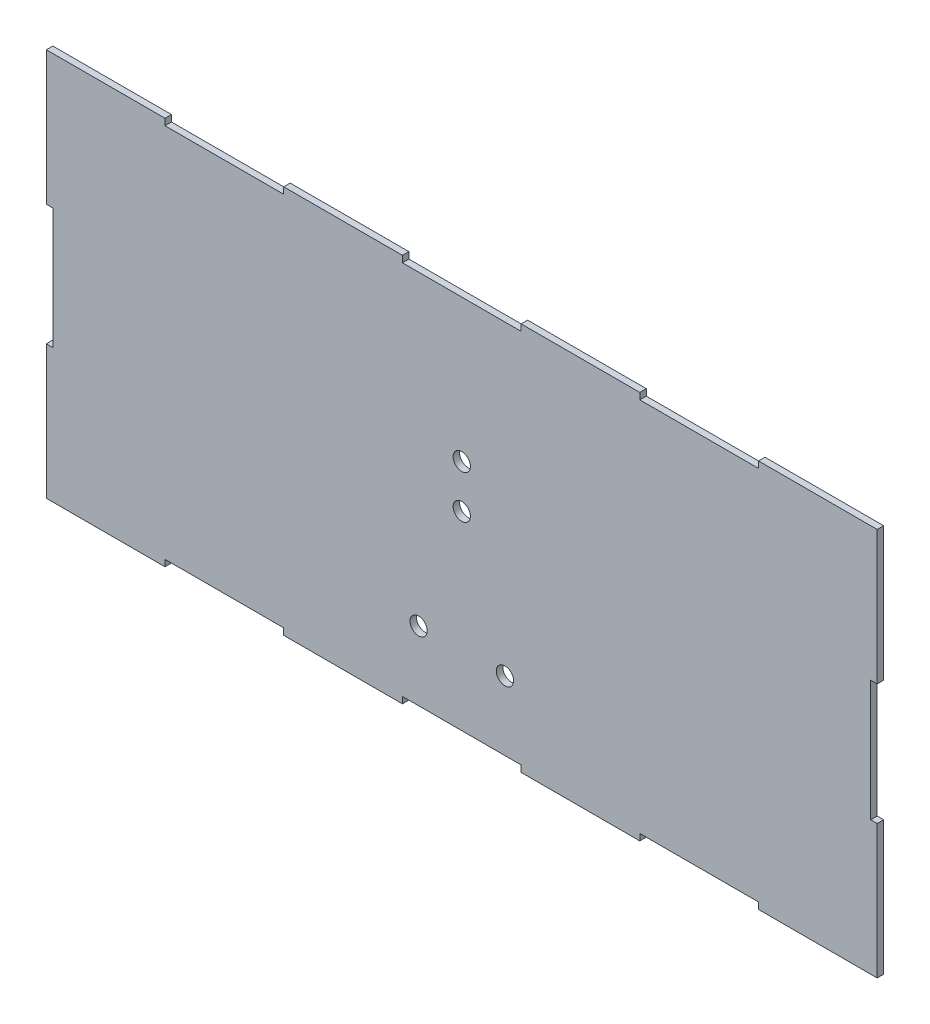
ISO-10303-21;
HEADER;
FILE_DESCRIPTION(('STEP AP214'),'2;1');
FILE_NAME('part.step','',(''),(''),'','','');
FILE_SCHEMA(('AUTOMOTIVE_DESIGN { 1 0 10303 214 1 1 1 1 }'));
ENDSEC;
DATA;
#1=APPLICATION_CONTEXT('core data for automotive mechanical design processes');
#2=APPLICATION_PROTOCOL_DEFINITION('international standard','automotive_design',2000,#1);
#3=PRODUCT_CONTEXT('',#1,'mechanical');
#4=PRODUCT('Part','Part','',(#3));
#5=PRODUCT_RELATED_PRODUCT_CATEGORY('part','',(#4));
#6=PRODUCT_DEFINITION_FORMATION('','',#4);
#7=PRODUCT_DEFINITION_CONTEXT('part definition',#1,'design');
#8=PRODUCT_DEFINITION('design','',#6,#7);
#9=PRODUCT_DEFINITION_SHAPE('','',#8);
#10=(LENGTH_UNIT() NAMED_UNIT(*) SI_UNIT(.MILLI.,.METRE.));
#11=(NAMED_UNIT(*) PLANE_ANGLE_UNIT() SI_UNIT($,.RADIAN.));
#12=(NAMED_UNIT(*) SI_UNIT($,.STERADIAN.) SOLID_ANGLE_UNIT());
#13=UNCERTAINTY_MEASURE_WITH_UNIT(LENGTH_MEASURE(1.E-05),#10,'distance_accuracy_value','');
#14=(GEOMETRIC_REPRESENTATION_CONTEXT(3) GLOBAL_UNCERTAINTY_ASSIGNED_CONTEXT((#13)) GLOBAL_UNIT_ASSIGNED_CONTEXT((#10,
#11,#12)) REPRESENTATION_CONTEXT('',''));
#15=CARTESIAN_POINT('',(0.,0.,0.));
#16=DIRECTION('',(0.,0.,1.));
#17=DIRECTION('',(1.,0.,0.));
#18=AXIS2_PLACEMENT_3D('',#15,#16,#17);
#19=CARTESIAN_POINT('',(192.5,90.,3.));
#20=DIRECTION('',(-1.,0.,0.));
#21=DIRECTION('',(0.,-1.,0.));
#22=AXIS2_PLACEMENT_3D('',#19,#20,#21);
#23=PLANE('',#22);
#24=DIRECTION('',(0.,1.,0.));
#25=VECTOR('',#24,1.);
#26=CARTESIAN_POINT('',(192.5,90.,3.));
#27=LINE('',#26,#25);
#28=CARTESIAN_POINT('',(192.5,28.,3.));
#29=VERTEX_POINT('',#28);
#30=CARTESIAN_POINT('',(192.5,90.,3.));
#31=VERTEX_POINT('',#30);
#32=EDGE_CURVE('E509',#29,#31,#27,.T.);
#33=ORIENTED_EDGE('',*,*,#32,.F.);
#34=DIRECTION('',(0.,0.,1.));
#35=VECTOR('',#34,1.);
#36=CARTESIAN_POINT('',(192.5,28.,0.));
#37=LINE('',#36,#35);
#38=CARTESIAN_POINT('',(192.5,28.,0.));
#39=VERTEX_POINT('',#38);
#40=EDGE_CURVE('E297',#39,#29,#37,.T.);
#41=ORIENTED_EDGE('',*,*,#40,.F.);
#42=DIRECTION('',(0.,1.,0.));
#43=VECTOR('',#42,1.);
#44=CARTESIAN_POINT('',(192.5,90.,0.));
#45=LINE('',#44,#43);
#46=CARTESIAN_POINT('',(192.5,90.,0.));
#47=VERTEX_POINT('',#46);
#48=EDGE_CURVE('E502',#39,#47,#45,.T.);
#49=ORIENTED_EDGE('',*,*,#48,.T.);
#50=DIRECTION('',(0.,0.,-1.));
#51=VECTOR('',#50,1.);
#52=CARTESIAN_POINT('',(192.5,90.,3.));
#53=LINE('',#52,#51);
#54=EDGE_CURVE('E11',#31,#47,#53,.T.);
#55=ORIENTED_EDGE('',*,*,#54,.F.);
#56=EDGE_LOOP('',(#33,#41,#49,#55));
#57=FACE_BOUND('',#56,.T.);
#58=ADVANCED_FACE('F32',(#57),#23,.F.);
#59=CARTESIAN_POINT('',(-192.5,90.,3.));
#60=DIRECTION('',(1.,0.,0.));
#61=DIRECTION('',(0.,1.,0.));
#62=AXIS2_PLACEMENT_3D('',#59,#60,#61);
#63=PLANE('',#62);
#64=DIRECTION('',(0.,-1.,0.));
#65=VECTOR('',#64,1.);
#66=CARTESIAN_POINT('',(-192.5,90.,0.));
#67=LINE('',#66,#65);
#68=CARTESIAN_POINT('',(-192.5,90.,0.));
#69=VERTEX_POINT('',#68);
#70=CARTESIAN_POINT('',(-192.5,28.,0.));
#71=VERTEX_POINT('',#70);
#72=EDGE_CURVE('E534',#69,#71,#67,.T.);
#73=ORIENTED_EDGE('',*,*,#72,.T.);
#74=DIRECTION('',(0.,0.,1.));
#75=VECTOR('',#74,1.);
#76=CARTESIAN_POINT('',(-192.5,28.,0.));
#77=LINE('',#76,#75);
#78=CARTESIAN_POINT('',(-192.5,28.,3.));
#79=VERTEX_POINT('',#78);
#80=EDGE_CURVE('E315',#71,#79,#77,.T.);
#81=ORIENTED_EDGE('',*,*,#80,.T.);
#82=DIRECTION('',(0.,-1.,0.));
#83=VECTOR('',#82,1.);
#84=CARTESIAN_POINT('',(-192.5,90.,3.));
#85=LINE('',#84,#83);
#86=CARTESIAN_POINT('',(-192.5,90.,3.));
#87=VERTEX_POINT('',#86);
#88=EDGE_CURVE('E516',#87,#79,#85,.T.);
#89=ORIENTED_EDGE('',*,*,#88,.F.);
#90=DIRECTION('',(0.,0.,-1.));
#91=VECTOR('',#90,1.);
#92=CARTESIAN_POINT('',(-192.5,90.,3.));
#93=LINE('',#92,#91);
#94=EDGE_CURVE('E40',#87,#69,#93,.T.);
#95=ORIENTED_EDGE('',*,*,#94,.T.);
#96=EDGE_LOOP('',(#73,#81,#89,#95));
#97=FACE_BOUND('',#96,.T.);
#98=ADVANCED_FACE('F551',(#97),#63,.F.);
#99=CARTESIAN_POINT('',(-192.5,90.,3.));
#100=DIRECTION('',(0.,-1.,0.));
#101=DIRECTION('',(0.,0.,-1.));
#102=AXIS2_PLACEMENT_3D('',#99,#100,#101);
#103=PLANE('',#102);
#104=DIRECTION('',(-1.,0.,0.));
#105=VECTOR('',#104,1.);
#106=CARTESIAN_POINT('',(-192.5,90.,0.));
#107=LINE('',#106,#105);
#108=CARTESIAN_POINT('',(-27.5000000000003,90.,0.));
#109=VERTEX_POINT('',#108);
#110=CARTESIAN_POINT('',(-82.5000000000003,90.,0.));
#111=VERTEX_POINT('',#110);
#112=EDGE_CURVE('E533',#109,#111,#107,.T.);
#113=ORIENTED_EDGE('',*,*,#112,.T.);
#114=DIRECTION('',(0.,0.,1.));
#115=VECTOR('',#114,1.);
#116=CARTESIAN_POINT('',(-82.5000000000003,90.,0.));
#117=LINE('',#116,#115);
#118=CARTESIAN_POINT('',(-82.5000000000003,90.,3.));
#119=VERTEX_POINT('',#118);
#120=EDGE_CURVE('E341',#111,#119,#117,.T.);
#121=ORIENTED_EDGE('',*,*,#120,.T.);
#122=DIRECTION('',(-1.,0.,0.));
#123=VECTOR('',#122,1.);
#124=CARTESIAN_POINT('',(-192.5,90.,3.));
#125=LINE('',#124,#123);
#126=CARTESIAN_POINT('',(-27.5000000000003,90.,3.));
#127=VERTEX_POINT('',#126);
#128=EDGE_CURVE('E515',#127,#119,#125,.T.);
#129=ORIENTED_EDGE('',*,*,#128,.F.);
#130=DIRECTION('',(0.,0.,1.));
#131=VECTOR('',#130,1.);
#132=CARTESIAN_POINT('',(-27.5000000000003,90.,0.));
#133=LINE('',#132,#131);
#134=EDGE_CURVE('E394',#109,#127,#133,.T.);
#135=ORIENTED_EDGE('',*,*,#134,.F.);
#136=EDGE_LOOP('',(#113,#121,#129,#135));
#137=FACE_BOUND('',#136,.T.);
#138=ADVANCED_FACE('F596',(#137),#103,.F.);
#139=CARTESIAN_POINT('',(137.5,90.,0.));
#140=VERTEX_POINT('',#139);
#141=EDGE_CURVE('E528',#47,#140,#107,.T.);
#142=ORIENTED_EDGE('',*,*,#141,.T.);
#143=DIRECTION('',(0.,0.,1.));
#144=VECTOR('',#143,1.);
#145=CARTESIAN_POINT('',(137.5,90.,0.));
#146=LINE('',#145,#144);
#147=CARTESIAN_POINT('',(137.5,90.,3.));
#148=VERTEX_POINT('',#147);
#149=EDGE_CURVE('E360',#140,#148,#146,.T.);
#150=ORIENTED_EDGE('',*,*,#149,.T.);
#151=EDGE_CURVE('E510',#31,#148,#125,.T.);
#152=ORIENTED_EDGE('',*,*,#151,.F.);
#153=ORIENTED_EDGE('',*,*,#54,.T.);
#154=EDGE_LOOP('',(#142,#150,#152,#153));
#155=FACE_BOUND('',#154,.T.);
#156=ADVANCED_FACE('F952',(#155),#103,.F.);
#157=CARTESIAN_POINT('',(-137.5,90.,3.));
#158=VERTEX_POINT('',#157);
#159=EDGE_CURVE('E508',#158,#87,#125,.T.);
#160=ORIENTED_EDGE('',*,*,#159,.F.);
#161=DIRECTION('',(0.,0.,1.));
#162=VECTOR('',#161,1.);
#163=CARTESIAN_POINT('',(-137.5,90.,0.));
#164=LINE('',#163,#162);
#165=CARTESIAN_POINT('',(-137.5,90.,0.));
#166=VERTEX_POINT('',#165);
#167=EDGE_CURVE('E334',#166,#158,#164,.T.);
#168=ORIENTED_EDGE('',*,*,#167,.F.);
#169=EDGE_CURVE('E527',#166,#69,#107,.T.);
#170=ORIENTED_EDGE('',*,*,#169,.T.);
#171=ORIENTED_EDGE('',*,*,#94,.F.);
#172=EDGE_LOOP('',(#160,#168,#170,#171));
#173=FACE_BOUND('',#172,.T.);
#174=ADVANCED_FACE('F583',(#173),#103,.F.);
#175=CARTESIAN_POINT('',(-192.5,-90.,3.));
#176=DIRECTION('',(0.,1.,0.));
#177=DIRECTION('',(0.,0.,1.));
#178=AXIS2_PLACEMENT_3D('',#175,#176,#177);
#179=PLANE('',#178);
#180=DIRECTION('',(1.,0.,0.));
#181=VECTOR('',#180,1.);
#182=CARTESIAN_POINT('',(-192.5,-90.,0.));
#183=LINE('',#182,#181);
#184=CARTESIAN_POINT('',(27.4999999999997,-90.,0.));
#185=VERTEX_POINT('',#184);
#186=CARTESIAN_POINT('',(82.5000000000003,-90.,0.));
#187=VERTEX_POINT('',#186);
#188=EDGE_CURVE('E636',#185,#187,#183,.T.);
#189=ORIENTED_EDGE('',*,*,#188,.T.);
#190=DIRECTION('',(0.,0.,1.));
#191=VECTOR('',#190,1.);
#192=CARTESIAN_POINT('',(82.5000000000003,-90.,0.));
#193=LINE('',#192,#191);
#194=CARTESIAN_POINT('',(82.5000000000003,-90.,3.));
#195=VERTEX_POINT('',#194);
#196=EDGE_CURVE('E420',#187,#195,#193,.T.);
#197=ORIENTED_EDGE('',*,*,#196,.T.);
#198=DIRECTION('',(1.,0.,0.));
#199=VECTOR('',#198,1.);
#200=CARTESIAN_POINT('',(-192.5,-90.,3.));
#201=LINE('',#200,#199);
#202=CARTESIAN_POINT('',(27.4999999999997,-90.,3.));
#203=VERTEX_POINT('',#202);
#204=EDGE_CURVE('E657',#203,#195,#201,.T.);
#205=ORIENTED_EDGE('',*,*,#204,.F.);
#206=DIRECTION('',(0.,0.,1.));
#207=VECTOR('',#206,1.);
#208=CARTESIAN_POINT('',(27.4999999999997,-90.,0.));
#209=LINE('',#208,#207);
#210=EDGE_CURVE('E446',#185,#203,#209,.T.);
#211=ORIENTED_EDGE('',*,*,#210,.F.);
#212=EDGE_LOOP('',(#189,#197,#205,#211));
#213=FACE_BOUND('',#212,.T.);
#214=ADVANCED_FACE('F667',(#213),#179,.F.);
#215=CARTESIAN_POINT('',(137.5,-90.,3.));
#216=VERTEX_POINT('',#215);
#217=CARTESIAN_POINT('',(192.5,-90.,3.));
#218=VERTEX_POINT('',#217);
#219=EDGE_CURVE('E519',#216,#218,#201,.T.);
#220=ORIENTED_EDGE('',*,*,#219,.F.);
#221=DIRECTION('',(0.,0.,1.));
#222=VECTOR('',#221,1.);
#223=CARTESIAN_POINT('',(137.5,-90.,0.));
#224=LINE('',#223,#222);
#225=CARTESIAN_POINT('',(137.5,-90.,0.));
#226=VERTEX_POINT('',#225);
#227=EDGE_CURVE('E413',#226,#216,#224,.T.);
#228=ORIENTED_EDGE('',*,*,#227,.F.);
#229=CARTESIAN_POINT('',(192.5,-90.,0.));
#230=VERTEX_POINT('',#229);
#231=EDGE_CURVE('E537',#226,#230,#183,.T.);
#232=ORIENTED_EDGE('',*,*,#231,.T.);
#233=DIRECTION('',(0.,0.,-1.));
#234=VECTOR('',#233,1.);
#235=CARTESIAN_POINT('',(192.5,-90.,3.));
#236=LINE('',#235,#234);
#237=EDGE_CURVE('E523',#218,#230,#236,.T.);
#238=ORIENTED_EDGE('',*,*,#237,.F.);
#239=EDGE_LOOP('',(#220,#228,#232,#238));
#240=FACE_BOUND('',#239,.T.);
#241=ADVANCED_FACE('F664',(#240),#179,.F.);
#242=CARTESIAN_POINT('',(-192.5,-90.,0.));
#243=VERTEX_POINT('',#242);
#244=CARTESIAN_POINT('',(-137.5,-90.,0.));
#245=VERTEX_POINT('',#244);
#246=EDGE_CURVE('E538',#243,#245,#183,.T.);
#247=ORIENTED_EDGE('',*,*,#246,.T.);
#248=DIRECTION('',(0.,0.,1.));
#249=VECTOR('',#248,1.);
#250=CARTESIAN_POINT('',(-137.5,-90.,0.));
#251=LINE('',#250,#249);
#252=CARTESIAN_POINT('',(-137.5,-90.,3.));
#253=VERTEX_POINT('',#252);
#254=EDGE_CURVE('E465',#245,#253,#251,.T.);
#255=ORIENTED_EDGE('',*,*,#254,.T.);
#256=CARTESIAN_POINT('',(-192.5,-90.,3.));
#257=VERTEX_POINT('',#256);
#258=EDGE_CURVE('E520',#257,#253,#201,.T.);
#259=ORIENTED_EDGE('',*,*,#258,.F.);
#260=DIRECTION('',(0.,0.,-1.));
#261=VECTOR('',#260,1.);
#262=CARTESIAN_POINT('',(-192.5,-90.,3.));
#263=LINE('',#262,#261);
#264=EDGE_CURVE('E544',#257,#243,#263,.T.);
#265=ORIENTED_EDGE('',*,*,#264,.T.);
#266=EDGE_LOOP('',(#247,#255,#259,#265));
#267=FACE_BOUND('',#266,.T.);
#268=ADVANCED_FACE('F666',(#267),#179,.F.);
#269=CARTESIAN_POINT('',(0.,0.,3.));
#270=DIRECTION('',(0.,0.,1.));
#271=DIRECTION('',(1.,0.,0.));
#272=AXIS2_PLACEMENT_3D('',#269,#270,#271);
#273=PLANE('',#272);
#274=DIRECTION('',(-1.,0.,0.));
#275=VECTOR('',#274,1.);
#276=CARTESIAN_POINT('',(189.5,28.,3.));
#277=LINE('',#276,#275);
#278=CARTESIAN_POINT('',(189.5,28.,3.));
#279=VERTEX_POINT('',#278);
#280=EDGE_CURVE('E286',#29,#279,#277,.T.);
#281=ORIENTED_EDGE('',*,*,#280,.F.);
#282=ORIENTED_EDGE('',*,*,#32,.T.);
#283=ORIENTED_EDGE('',*,*,#151,.T.);
#284=DIRECTION('',(0.,1.,0.));
#285=VECTOR('',#284,1.);
#286=CARTESIAN_POINT('',(137.5,90.,3.));
#287=LINE('',#286,#285);
#288=CARTESIAN_POINT('',(137.5,87.,3.));
#289=VERTEX_POINT('',#288);
#290=EDGE_CURVE('E344',#289,#148,#287,.T.);
#291=ORIENTED_EDGE('',*,*,#290,.F.);
#292=DIRECTION('',(1.,0.,0.));
#293=VECTOR('',#292,1.);
#294=CARTESIAN_POINT('',(137.5,87.,3.));
#295=LINE('',#294,#293);
#296=CARTESIAN_POINT('',(82.5000000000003,87.,3.));
#297=VERTEX_POINT('',#296);
#298=EDGE_CURVE('E354',#297,#289,#295,.T.);
#299=ORIENTED_EDGE('',*,*,#298,.F.);
#300=DIRECTION('',(0.,-1.,0.));
#301=VECTOR('',#300,1.);
#302=CARTESIAN_POINT('',(82.5000000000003,90.,3.));
#303=LINE('',#302,#301);
#304=CARTESIAN_POINT('',(82.5000000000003,90.,3.));
#305=VERTEX_POINT('',#304);
#306=EDGE_CURVE('E362',#305,#297,#303,.T.);
#307=ORIENTED_EDGE('',*,*,#306,.F.);
#308=CARTESIAN_POINT('',(27.4999999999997,90.,3.));
#309=VERTEX_POINT('',#308);
#310=EDGE_CURVE('E514',#305,#309,#125,.T.);
#311=ORIENTED_EDGE('',*,*,#310,.T.);
#312=DIRECTION('',(0.,1.,0.));
#313=VECTOR('',#312,1.);
#314=CARTESIAN_POINT('',(27.4999999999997,87.,3.));
#315=LINE('',#314,#313);
#316=CARTESIAN_POINT('',(27.4999999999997,87.,3.));
#317=VERTEX_POINT('',#316);
#318=EDGE_CURVE('E380',#317,#309,#315,.T.);
#319=ORIENTED_EDGE('',*,*,#318,.F.);
#320=DIRECTION('',(1.,0.,0.));
#321=VECTOR('',#320,1.);
#322=CARTESIAN_POINT('',(-27.5000000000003,87.,3.));
#323=LINE('',#322,#321);
#324=CARTESIAN_POINT('',(-27.5000000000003,87.,3.));
#325=VERTEX_POINT('',#324);
#326=EDGE_CURVE('E389',#325,#317,#323,.T.);
#327=ORIENTED_EDGE('',*,*,#326,.F.);
#328=DIRECTION('',(0.,-1.,0.));
#329=VECTOR('',#328,1.);
#330=CARTESIAN_POINT('',(-27.5000000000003,87.,3.));
#331=LINE('',#330,#329);
#332=EDGE_CURVE('E369',#127,#325,#331,.T.);
#333=ORIENTED_EDGE('',*,*,#332,.F.);
#334=ORIENTED_EDGE('',*,*,#128,.T.);
#335=DIRECTION('',(0.,1.,0.));
#336=VECTOR('',#335,1.);
#337=CARTESIAN_POINT('',(-82.5000000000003,90.,3.));
#338=LINE('',#337,#336);
#339=CARTESIAN_POINT('',(-82.5000000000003,87.,3.));
#340=VERTEX_POINT('',#339);
#341=EDGE_CURVE('E328',#340,#119,#338,.T.);
#342=ORIENTED_EDGE('',*,*,#341,.F.);
#343=DIRECTION('',(1.,0.,0.));
#344=VECTOR('',#343,1.);
#345=CARTESIAN_POINT('',(-137.5,87.,3.));
#346=LINE('',#345,#344);
#347=CARTESIAN_POINT('',(-137.5,87.,3.));
#348=VERTEX_POINT('',#347);
#349=EDGE_CURVE('E337',#348,#340,#346,.T.);
#350=ORIENTED_EDGE('',*,*,#349,.F.);
#351=DIRECTION('',(0.,-1.,0.));
#352=VECTOR('',#351,1.);
#353=CARTESIAN_POINT('',(-137.5,90.,3.));
#354=LINE('',#353,#352);
#355=EDGE_CURVE('E318',#158,#348,#354,.T.);
#356=ORIENTED_EDGE('',*,*,#355,.F.);
#357=ORIENTED_EDGE('',*,*,#159,.T.);
#358=ORIENTED_EDGE('',*,*,#88,.T.);
#359=DIRECTION('',(-1.,0.,0.));
#360=VECTOR('',#359,1.);
#361=CARTESIAN_POINT('',(-189.5,28.,3.));
#362=LINE('',#361,#360);
#363=CARTESIAN_POINT('',(-189.5,28.,3.));
#364=VERTEX_POINT('',#363);
#365=EDGE_CURVE('E302',#364,#79,#362,.T.);
#366=ORIENTED_EDGE('',*,*,#365,.F.);
#367=DIRECTION('',(0.,1.,0.));
#368=VECTOR('',#367,1.);
#369=CARTESIAN_POINT('',(-189.5,-28.,3.));
#370=LINE('',#369,#368);
#371=CARTESIAN_POINT('',(-189.5,-28.,3.));
#372=VERTEX_POINT('',#371);
#373=EDGE_CURVE('E311',#372,#364,#370,.T.);
#374=ORIENTED_EDGE('',*,*,#373,.F.);
#375=DIRECTION('',(1.,0.,0.));
#376=VECTOR('',#375,1.);
#377=CARTESIAN_POINT('',(-189.5,-28.,3.));
#378=LINE('',#377,#376);
#379=CARTESIAN_POINT('',(-192.5,-28.,3.));
#380=VERTEX_POINT('',#379);
#381=EDGE_CURVE('E296',#380,#372,#378,.T.);
#382=ORIENTED_EDGE('',*,*,#381,.F.);
#383=EDGE_CURVE('E513',#380,#257,#85,.T.);
#384=ORIENTED_EDGE('',*,*,#383,.T.);
#385=ORIENTED_EDGE('',*,*,#258,.T.);
#386=DIRECTION('',(0.,-1.,0.));
#387=VECTOR('',#386,1.);
#388=CARTESIAN_POINT('',(-137.5,-90.,3.));
#389=LINE('',#388,#387);
#390=CARTESIAN_POINT('',(-137.5,-87.,3.));
#391=VERTEX_POINT('',#390);
#392=EDGE_CURVE('E448',#391,#253,#389,.T.);
#393=ORIENTED_EDGE('',*,*,#392,.F.);
#394=DIRECTION('',(-1.,0.,0.));
#395=VECTOR('',#394,1.);
#396=CARTESIAN_POINT('',(-137.5,-87.,3.));
#397=LINE('',#396,#395);
#398=CARTESIAN_POINT('',(-82.5000000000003,-87.,3.));
#399=VERTEX_POINT('',#398);
#400=EDGE_CURVE('E459',#399,#391,#397,.T.);
#401=ORIENTED_EDGE('',*,*,#400,.F.);
#402=DIRECTION('',(0.,1.,0.));
#403=VECTOR('',#402,1.);
#404=CARTESIAN_POINT('',(-82.5000000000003,-90.,3.));
#405=LINE('',#404,#403);
#406=CARTESIAN_POINT('',(-82.5000000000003,-90.,3.));
#407=VERTEX_POINT('',#406);
#408=EDGE_CURVE('E467',#407,#399,#405,.T.);
#409=ORIENTED_EDGE('',*,*,#408,.F.);
#410=CARTESIAN_POINT('',(-27.5000000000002,-90.,3.));
#411=VERTEX_POINT('',#410);
#412=EDGE_CURVE('E524',#407,#411,#201,.T.);
#413=ORIENTED_EDGE('',*,*,#412,.T.);
#414=DIRECTION('',(0.,-1.,0.));
#415=VECTOR('',#414,1.);
#416=CARTESIAN_POINT('',(-27.5000000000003,-87.,3.));
#417=LINE('',#416,#415);
#418=CARTESIAN_POINT('',(-27.5000000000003,-87.,3.));
#419=VERTEX_POINT('',#418);
#420=EDGE_CURVE('E433',#419,#411,#417,.T.);
#421=ORIENTED_EDGE('',*,*,#420,.F.);
#422=DIRECTION('',(-1.,0.,0.));
#423=VECTOR('',#422,1.);
#424=CARTESIAN_POINT('',(-27.5000000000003,-87.,3.));
#425=LINE('',#424,#423);
#426=CARTESIAN_POINT('',(27.4999999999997,-87.,3.));
#427=VERTEX_POINT('',#426);
#428=EDGE_CURVE('E442',#427,#419,#425,.T.);
#429=ORIENTED_EDGE('',*,*,#428,.F.);
#430=DIRECTION('',(0.,1.,0.));
#431=VECTOR('',#430,1.);
#432=CARTESIAN_POINT('',(27.4999999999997,-87.,3.));
#433=LINE('',#432,#431);
#434=EDGE_CURVE('E423',#203,#427,#433,.T.);
#435=ORIENTED_EDGE('',*,*,#434,.F.);
#436=ORIENTED_EDGE('',*,*,#204,.T.);
#437=DIRECTION('',(0.,-1.,0.));
#438=VECTOR('',#437,1.);
#439=CARTESIAN_POINT('',(82.5000000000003,-90.,3.));
#440=LINE('',#439,#438);
#441=CARTESIAN_POINT('',(82.5000000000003,-87.,3.));
#442=VERTEX_POINT('',#441);
#443=EDGE_CURVE('E407',#442,#195,#440,.T.);
#444=ORIENTED_EDGE('',*,*,#443,.F.);
#445=DIRECTION('',(-1.,0.,0.));
#446=VECTOR('',#445,1.);
#447=CARTESIAN_POINT('',(137.5,-87.,3.));
#448=LINE('',#447,#446);
#449=CARTESIAN_POINT('',(137.5,-87.,3.));
#450=VERTEX_POINT('',#449);
#451=EDGE_CURVE('E416',#450,#442,#448,.T.);
#452=ORIENTED_EDGE('',*,*,#451,.F.);
#453=DIRECTION('',(0.,1.,0.));
#454=VECTOR('',#453,1.);
#455=CARTESIAN_POINT('',(137.5,-90.,3.));
#456=LINE('',#455,#454);
#457=EDGE_CURVE('E396',#216,#450,#456,.T.);
#458=ORIENTED_EDGE('',*,*,#457,.F.);
#459=ORIENTED_EDGE('',*,*,#219,.T.);
#460=CARTESIAN_POINT('',(192.5,-28.,3.));
#461=VERTEX_POINT('',#460);
#462=EDGE_CURVE('E505',#218,#461,#27,.T.);
#463=ORIENTED_EDGE('',*,*,#462,.T.);
#464=DIRECTION('',(1.,0.,0.));
#465=VECTOR('',#464,1.);
#466=CARTESIAN_POINT('',(189.5,-28.,3.));
#467=LINE('',#466,#465);
#468=CARTESIAN_POINT('',(189.5,-28.,3.));
#469=VERTEX_POINT('',#468);
#470=EDGE_CURVE('E47',#469,#461,#467,.T.);
#471=ORIENTED_EDGE('',*,*,#470,.F.);
#472=DIRECTION('',(0.,-1.,0.));
#473=VECTOR('',#472,1.);
#474=CARTESIAN_POINT('',(189.5,-28.,3.));
#475=LINE('',#474,#473);
#476=EDGE_CURVE('E272',#279,#469,#475,.T.);
#477=ORIENTED_EDGE('',*,*,#476,.F.);
#478=EDGE_LOOP('',(#281,#282,#283,#291,#299,#307,#311,#319,#327,#333,#334,#342,#350,#356,#357,
#358,#366,#374,#382,#384,#385,#393,#401,#409,#413,#421,#429,#435,#436,#444,#452,#458,#459,#463,
#471,#477));
#479=FACE_BOUND('',#478,.T.);
#480=CARTESIAN_POINT('',(0.,1.00000000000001,3.));
#481=DIRECTION('',(0.,0.,1.));
#482=DIRECTION('',(1.,0.,0.));
#483=AXIS2_PLACEMENT_3D('',#480,#481,#482);
#484=CIRCLE('',#483,4.);
#485=CARTESIAN_POINT('',(4.,1.00000000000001,3.));
#486=VERTEX_POINT('',#485);
#487=EDGE_CURVE('E487',#486,#486,#484,.T.);
#488=ORIENTED_EDGE('',*,*,#487,.F.);
#489=EDGE_LOOP('',(#488));
#490=FACE_BOUND('',#489,.T.);
#491=CARTESIAN_POINT('',(-20.,-55.,3.));
#492=DIRECTION('',(0.,0.,1.));
#493=DIRECTION('',(1.,0.,0.));
#494=AXIS2_PLACEMENT_3D('',#491,#492,#493);
#495=CIRCLE('',#494,4.);
#496=CARTESIAN_POINT('',(-16.,-55.,3.));
#497=VERTEX_POINT('',#496);
#498=EDGE_CURVE('E499',#497,#497,#495,.T.);
#499=ORIENTED_EDGE('',*,*,#498,.F.);
#500=EDGE_LOOP('',(#499));
#501=FACE_BOUND('',#500,.T.);
#502=CARTESIAN_POINT('',(0.,21.,3.));
#503=DIRECTION('',(0.,0.,1.));
#504=DIRECTION('',(1.,0.,0.));
#505=AXIS2_PLACEMENT_3D('',#502,#503,#504);
#506=CIRCLE('',#505,4.00000000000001);
#507=CARTESIAN_POINT('',(4.00000000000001,21.,3.));
#508=VERTEX_POINT('',#507);
#509=EDGE_CURVE('E493',#508,#508,#506,.T.);
#510=ORIENTED_EDGE('',*,*,#509,.F.);
#511=EDGE_LOOP('',(#510));
#512=FACE_BOUND('',#511,.T.);
#513=CARTESIAN_POINT('',(20.,-55.,3.));
#514=DIRECTION('',(0.,0.,1.));
#515=DIRECTION('',(-1.,0.,0.));
#516=AXIS2_PLACEMENT_3D('',#513,#514,#515);
#517=CIRCLE('',#516,4.);
#518=CARTESIAN_POINT('',(16.,-55.,3.));
#519=VERTEX_POINT('',#518);
#520=EDGE_CURVE('E481',#519,#519,#517,.T.);
#521=ORIENTED_EDGE('',*,*,#520,.F.);
#522=EDGE_LOOP('',(#521));
#523=FACE_BOUND('',#522,.T.);
#524=ADVANCED_FACE('F562',(#479,#490,#501,#512,#523),#273,.T.);
#525=CARTESIAN_POINT('',(0.,0.,0.));
#526=DIRECTION('',(0.,0.,1.));
#527=DIRECTION('',(1.,0.,0.));
#528=AXIS2_PLACEMENT_3D('',#525,#526,#527);
#529=PLANE('',#528);
#530=ORIENTED_EDGE('',*,*,#48,.F.);
#531=DIRECTION('',(-1.,0.,0.));
#532=VECTOR('',#531,1.);
#533=CARTESIAN_POINT('',(189.5,28.,0.));
#534=LINE('',#533,#532);
#535=CARTESIAN_POINT('',(189.5,28.,0.));
#536=VERTEX_POINT('',#535);
#537=EDGE_CURVE('E274',#39,#536,#534,.T.);
#538=ORIENTED_EDGE('',*,*,#537,.T.);
#539=DIRECTION('',(0.,-1.,0.));
#540=VECTOR('',#539,1.);
#541=CARTESIAN_POINT('',(189.5,-28.,0.));
#542=LINE('',#541,#540);
#543=CARTESIAN_POINT('',(189.5,-28.,0.));
#544=VERTEX_POINT('',#543);
#545=EDGE_CURVE('E269',#536,#544,#542,.T.);
#546=ORIENTED_EDGE('',*,*,#545,.T.);
#547=DIRECTION('',(1.,0.,0.));
#548=VECTOR('',#547,1.);
#549=CARTESIAN_POINT('',(189.5,-28.,0.));
#550=LINE('',#549,#548);
#551=CARTESIAN_POINT('',(192.5,-28.,0.));
#552=VERTEX_POINT('',#551);
#553=EDGE_CURVE('E277',#544,#552,#550,.T.);
#554=ORIENTED_EDGE('',*,*,#553,.T.);
#555=EDGE_CURVE('E525',#230,#552,#45,.T.);
#556=ORIENTED_EDGE('',*,*,#555,.F.);
#557=ORIENTED_EDGE('',*,*,#231,.F.);
#558=DIRECTION('',(0.,1.,0.));
#559=VECTOR('',#558,1.);
#560=CARTESIAN_POINT('',(137.5,-90.,0.));
#561=LINE('',#560,#559);
#562=CARTESIAN_POINT('',(137.5,-87.,0.));
#563=VERTEX_POINT('',#562);
#564=EDGE_CURVE('E403',#226,#563,#561,.T.);
#565=ORIENTED_EDGE('',*,*,#564,.T.);
#566=DIRECTION('',(-1.,0.,0.));
#567=VECTOR('',#566,1.);
#568=CARTESIAN_POINT('',(137.5,-87.,0.));
#569=LINE('',#568,#567);
#570=CARTESIAN_POINT('',(82.5000000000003,-87.,0.));
#571=VERTEX_POINT('',#570);
#572=EDGE_CURVE('E406',#563,#571,#569,.T.);
#573=ORIENTED_EDGE('',*,*,#572,.T.);
#574=DIRECTION('',(0.,-1.,0.));
#575=VECTOR('',#574,1.);
#576=CARTESIAN_POINT('',(82.5000000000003,-90.,0.));
#577=LINE('',#576,#575);
#578=EDGE_CURVE('E410',#571,#187,#577,.T.);
#579=ORIENTED_EDGE('',*,*,#578,.T.);
#580=ORIENTED_EDGE('',*,*,#188,.F.);
#581=DIRECTION('',(0.,1.,0.));
#582=VECTOR('',#581,1.);
#583=CARTESIAN_POINT('',(27.4999999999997,-87.,0.));
#584=LINE('',#583,#582);
#585=CARTESIAN_POINT('',(27.4999999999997,-87.,0.));
#586=VERTEX_POINT('',#585);
#587=EDGE_CURVE('E429',#185,#586,#584,.T.);
#588=ORIENTED_EDGE('',*,*,#587,.T.);
#589=DIRECTION('',(-1.,0.,0.));
#590=VECTOR('',#589,1.);
#591=CARTESIAN_POINT('',(-27.5000000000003,-87.,0.));
#592=LINE('',#591,#590);
#593=CARTESIAN_POINT('',(-27.5000000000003,-87.,0.));
#594=VERTEX_POINT('',#593);
#595=EDGE_CURVE('E432',#586,#594,#592,.T.);
#596=ORIENTED_EDGE('',*,*,#595,.T.);
#597=DIRECTION('',(0.,-1.,0.));
#598=VECTOR('',#597,1.);
#599=CARTESIAN_POINT('',(-27.5000000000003,-87.,0.));
#600=LINE('',#599,#598);
#601=CARTESIAN_POINT('',(-27.5000000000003,-90.,0.));
#602=VERTEX_POINT('',#601);
#603=EDGE_CURVE('E436',#594,#602,#600,.T.);
#604=ORIENTED_EDGE('',*,*,#603,.T.);
#605=CARTESIAN_POINT('',(-82.5000000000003,-90.,0.));
#606=VERTEX_POINT('',#605);
#607=EDGE_CURVE('E541',#606,#602,#183,.T.);
#608=ORIENTED_EDGE('',*,*,#607,.F.);
#609=DIRECTION('',(0.,1.,0.));
#610=VECTOR('',#609,1.);
#611=CARTESIAN_POINT('',(-82.5000000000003,-90.,0.));
#612=LINE('',#611,#610);
#613=CARTESIAN_POINT('',(-82.5000000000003,-87.,0.));
#614=VERTEX_POINT('',#613);
#615=EDGE_CURVE('E458',#606,#614,#612,.T.);
#616=ORIENTED_EDGE('',*,*,#615,.T.);
#617=DIRECTION('',(-1.,0.,0.));
#618=VECTOR('',#617,1.);
#619=CARTESIAN_POINT('',(-137.5,-87.,0.));
#620=LINE('',#619,#618);
#621=CARTESIAN_POINT('',(-137.5,-87.,0.));
#622=VERTEX_POINT('',#621);
#623=EDGE_CURVE('E462',#614,#622,#620,.T.);
#624=ORIENTED_EDGE('',*,*,#623,.T.);
#625=DIRECTION('',(0.,-1.,0.));
#626=VECTOR('',#625,1.);
#627=CARTESIAN_POINT('',(-137.5,-90.,0.));
#628=LINE('',#627,#626);
#629=EDGE_CURVE('E455',#622,#245,#628,.T.);
#630=ORIENTED_EDGE('',*,*,#629,.T.);
#631=ORIENTED_EDGE('',*,*,#246,.F.);
#632=CARTESIAN_POINT('',(-192.5,-28.,0.));
#633=VERTEX_POINT('',#632);
#634=EDGE_CURVE('E531',#633,#243,#67,.T.);
#635=ORIENTED_EDGE('',*,*,#634,.F.);
#636=DIRECTION('',(1.,0.,0.));
#637=VECTOR('',#636,1.);
#638=CARTESIAN_POINT('',(-189.5,-28.,0.));
#639=LINE('',#638,#637);
#640=CARTESIAN_POINT('',(-189.5,-28.,0.));
#641=VERTEX_POINT('',#640);
#642=EDGE_CURVE('E55',#633,#641,#639,.T.);
#643=ORIENTED_EDGE('',*,*,#642,.T.);
#644=DIRECTION('',(0.,1.,0.));
#645=VECTOR('',#644,1.);
#646=CARTESIAN_POINT('',(-189.5,-28.,0.));
#647=LINE('',#646,#645);
#648=CARTESIAN_POINT('',(-189.5,28.,0.));
#649=VERTEX_POINT('',#648);
#650=EDGE_CURVE('E301',#641,#649,#647,.T.);
#651=ORIENTED_EDGE('',*,*,#650,.T.);
#652=DIRECTION('',(-1.,0.,0.));
#653=VECTOR('',#652,1.);
#654=CARTESIAN_POINT('',(-189.5,28.,0.));
#655=LINE('',#654,#653);
#656=EDGE_CURVE('E305',#649,#71,#655,.T.);
#657=ORIENTED_EDGE('',*,*,#656,.T.);
#658=ORIENTED_EDGE('',*,*,#72,.F.);
#659=ORIENTED_EDGE('',*,*,#169,.F.);
#660=DIRECTION('',(0.,-1.,0.));
#661=VECTOR('',#660,1.);
#662=CARTESIAN_POINT('',(-137.5,90.,0.));
#663=LINE('',#662,#661);
#664=CARTESIAN_POINT('',(-137.5,87.,0.));
#665=VERTEX_POINT('',#664);
#666=EDGE_CURVE('E324',#166,#665,#663,.T.);
#667=ORIENTED_EDGE('',*,*,#666,.T.);
#668=DIRECTION('',(1.,0.,0.));
#669=VECTOR('',#668,1.);
#670=CARTESIAN_POINT('',(-137.5,87.,0.));
#671=LINE('',#670,#669);
#672=CARTESIAN_POINT('',(-82.5000000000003,87.,0.));
#673=VERTEX_POINT('',#672);
#674=EDGE_CURVE('E327',#665,#673,#671,.T.);
#675=ORIENTED_EDGE('',*,*,#674,.T.);
#676=DIRECTION('',(0.,1.,0.));
#677=VECTOR('',#676,1.);
#678=CARTESIAN_POINT('',(-82.5000000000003,90.,0.));
#679=LINE('',#678,#677);
#680=EDGE_CURVE('E331',#673,#111,#679,.T.);
#681=ORIENTED_EDGE('',*,*,#680,.T.);
#682=ORIENTED_EDGE('',*,*,#112,.F.);
#683=DIRECTION('',(0.,-1.,0.));
#684=VECTOR('',#683,1.);
#685=CARTESIAN_POINT('',(-27.5000000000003,87.,0.));
#686=LINE('',#685,#684);
#687=CARTESIAN_POINT('',(-27.5000000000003,87.,0.));
#688=VERTEX_POINT('',#687);
#689=EDGE_CURVE('E376',#109,#688,#686,.T.);
#690=ORIENTED_EDGE('',*,*,#689,.T.);
#691=DIRECTION('',(1.,0.,0.));
#692=VECTOR('',#691,1.);
#693=CARTESIAN_POINT('',(-27.5000000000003,87.,0.));
#694=LINE('',#693,#692);
#695=CARTESIAN_POINT('',(27.4999999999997,87.,0.));
#696=VERTEX_POINT('',#695);
#697=EDGE_CURVE('E379',#688,#696,#694,.T.);
#698=ORIENTED_EDGE('',*,*,#697,.T.);
#699=DIRECTION('',(0.,1.,0.));
#700=VECTOR('',#699,1.);
#701=CARTESIAN_POINT('',(27.4999999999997,87.,0.));
#702=LINE('',#701,#700);
#703=CARTESIAN_POINT('',(27.4999999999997,90.,0.));
#704=VERTEX_POINT('',#703);
#705=EDGE_CURVE('E383',#696,#704,#702,.T.);
#706=ORIENTED_EDGE('',*,*,#705,.T.);
#707=CARTESIAN_POINT('',(82.5000000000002,90.,0.));
#708=VERTEX_POINT('',#707);
#709=EDGE_CURVE('E532',#708,#704,#107,.T.);
#710=ORIENTED_EDGE('',*,*,#709,.F.);
#711=DIRECTION('',(0.,-1.,0.));
#712=VECTOR('',#711,1.);
#713=CARTESIAN_POINT('',(82.5000000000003,90.,0.));
#714=LINE('',#713,#712);
#715=CARTESIAN_POINT('',(82.5000000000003,87.,0.));
#716=VERTEX_POINT('',#715);
#717=EDGE_CURVE('E353',#708,#716,#714,.T.);
#718=ORIENTED_EDGE('',*,*,#717,.T.);
#719=DIRECTION('',(1.,0.,0.));
#720=VECTOR('',#719,1.);
#721=CARTESIAN_POINT('',(137.5,87.,0.));
#722=LINE('',#721,#720);
#723=CARTESIAN_POINT('',(137.5,87.,0.));
#724=VERTEX_POINT('',#723);
#725=EDGE_CURVE('E357',#716,#724,#722,.T.);
#726=ORIENTED_EDGE('',*,*,#725,.T.);
#727=DIRECTION('',(0.,1.,0.));
#728=VECTOR('',#727,1.);
#729=CARTESIAN_POINT('',(137.5,90.,0.));
#730=LINE('',#729,#728);
#731=EDGE_CURVE('E350',#724,#140,#730,.T.);
#732=ORIENTED_EDGE('',*,*,#731,.T.);
#733=ORIENTED_EDGE('',*,*,#141,.F.);
#734=EDGE_LOOP('',(#530,#538,#546,#554,#556,#557,#565,#573,#579,#580,#588,#596,#604,#608,#616,
#624,#630,#631,#635,#643,#651,#657,#658,#659,#667,#675,#681,#682,#690,#698,#706,#710,#718,#726,
#732,#733));
#735=FACE_BOUND('',#734,.T.);
#736=CARTESIAN_POINT('',(-20.,-55.,0.));
#737=DIRECTION('',(0.,0.,1.));
#738=DIRECTION('',(1.,0.,0.));
#739=AXIS2_PLACEMENT_3D('',#736,#737,#738);
#740=CIRCLE('',#739,4.);
#741=CARTESIAN_POINT('',(-16.,-55.,0.));
#742=VERTEX_POINT('',#741);
#743=EDGE_CURVE('E496',#742,#742,#740,.T.);
#744=ORIENTED_EDGE('',*,*,#743,.T.);
#745=EDGE_LOOP('',(#744));
#746=FACE_BOUND('',#745,.T.);
#747=CARTESIAN_POINT('',(0.,21.,0.));
#748=DIRECTION('',(0.,0.,1.));
#749=DIRECTION('',(1.,0.,0.));
#750=AXIS2_PLACEMENT_3D('',#747,#748,#749);
#751=CIRCLE('',#750,4.00000000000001);
#752=CARTESIAN_POINT('',(4.00000000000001,21.,0.));
#753=VERTEX_POINT('',#752);
#754=EDGE_CURVE('E490',#753,#753,#751,.T.);
#755=ORIENTED_EDGE('',*,*,#754,.T.);
#756=EDGE_LOOP('',(#755));
#757=FACE_BOUND('',#756,.T.);
#758=CARTESIAN_POINT('',(0.,1.00000000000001,0.));
#759=DIRECTION('',(0.,0.,1.));
#760=DIRECTION('',(1.,0.,0.));
#761=AXIS2_PLACEMENT_3D('',#758,#759,#760);
#762=CIRCLE('',#761,4.);
#763=CARTESIAN_POINT('',(4.,1.00000000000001,0.));
#764=VERTEX_POINT('',#763);
#765=EDGE_CURVE('E484',#764,#764,#762,.T.);
#766=ORIENTED_EDGE('',*,*,#765,.T.);
#767=EDGE_LOOP('',(#766));
#768=FACE_BOUND('',#767,.T.);
#769=CARTESIAN_POINT('',(20.,-55.,0.));
#770=DIRECTION('',(0.,0.,1.));
#771=DIRECTION('',(-1.,0.,0.));
#772=AXIS2_PLACEMENT_3D('',#769,#770,#771);
#773=CIRCLE('',#772,4.);
#774=CARTESIAN_POINT('',(16.,-55.,0.));
#775=VERTEX_POINT('',#774);
#776=EDGE_CURVE('E474',#775,#775,#773,.T.);
#777=ORIENTED_EDGE('',*,*,#776,.T.);
#778=EDGE_LOOP('',(#777));
#779=FACE_BOUND('',#778,.T.);
#780=ADVANCED_FACE('F284',(#735,#746,#757,#768,#779),#529,.F.);
#781=ORIENTED_EDGE('',*,*,#555,.T.);
#782=DIRECTION('',(0.,0.,1.));
#783=VECTOR('',#782,1.);
#784=CARTESIAN_POINT('',(192.5,-28.,0.));
#785=LINE('',#784,#783);
#786=EDGE_CURVE('E273',#552,#461,#785,.T.);
#787=ORIENTED_EDGE('',*,*,#786,.T.);
#788=ORIENTED_EDGE('',*,*,#462,.F.);
#789=ORIENTED_EDGE('',*,*,#237,.T.);
#790=EDGE_LOOP('',(#781,#787,#788,#789));
#791=FACE_BOUND('',#790,.T.);
#792=ADVANCED_FACE('F34',(#791),#23,.F.);
#793=ORIENTED_EDGE('',*,*,#310,.F.);
#794=DIRECTION('',(0.,0.,1.));
#795=VECTOR('',#794,1.);
#796=CARTESIAN_POINT('',(82.5000000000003,90.,0.));
#797=LINE('',#796,#795);
#798=EDGE_CURVE('E372',#708,#305,#797,.T.);
#799=ORIENTED_EDGE('',*,*,#798,.F.);
#800=ORIENTED_EDGE('',*,*,#709,.T.);
#801=DIRECTION('',(0.,0.,1.));
#802=VECTOR('',#801,1.);
#803=CARTESIAN_POINT('',(27.4999999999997,90.,0.));
#804=LINE('',#803,#802);
#805=EDGE_CURVE('E397',#704,#309,#804,.T.);
#806=ORIENTED_EDGE('',*,*,#805,.T.);
#807=EDGE_LOOP('',(#793,#799,#800,#806));
#808=FACE_BOUND('',#807,.T.);
#809=ADVANCED_FACE('F580',(#808),#103,.F.);
#810=ORIENTED_EDGE('',*,*,#383,.F.);
#811=DIRECTION('',(0.,0.,1.));
#812=VECTOR('',#811,1.);
#813=CARTESIAN_POINT('',(-192.5,-28.,0.));
#814=LINE('',#813,#812);
#815=EDGE_CURVE('E308',#633,#380,#814,.T.);
#816=ORIENTED_EDGE('',*,*,#815,.F.);
#817=ORIENTED_EDGE('',*,*,#634,.T.);
#818=ORIENTED_EDGE('',*,*,#264,.F.);
#819=EDGE_LOOP('',(#810,#816,#817,#818));
#820=FACE_BOUND('',#819,.T.);
#821=ADVANCED_FACE('F622',(#820),#63,.F.);
#822=ORIENTED_EDGE('',*,*,#607,.T.);
#823=DIRECTION('',(0.,0.,1.));
#824=VECTOR('',#823,1.);
#825=CARTESIAN_POINT('',(-27.5000000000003,-90.,0.));
#826=LINE('',#825,#824);
#827=EDGE_CURVE('E449',#602,#411,#826,.T.);
#828=ORIENTED_EDGE('',*,*,#827,.T.);
#829=ORIENTED_EDGE('',*,*,#412,.F.);
#830=DIRECTION('',(0.,0.,1.));
#831=VECTOR('',#830,1.);
#832=CARTESIAN_POINT('',(-82.5000000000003,-90.,0.));
#833=LINE('',#832,#831);
#834=EDGE_CURVE('E477',#606,#407,#833,.T.);
#835=ORIENTED_EDGE('',*,*,#834,.F.);
#836=EDGE_LOOP('',(#822,#828,#829,#835));
#837=FACE_BOUND('',#836,.T.);
#838=ADVANCED_FACE('F645',(#837),#179,.F.);
#839=CARTESIAN_POINT('',(-20.,-55.,3.));
#840=DIRECTION('',(0.,0.,-1.));
#841=DIRECTION('',(-1.,0.,0.));
#842=AXIS2_PLACEMENT_3D('',#839,#840,#841);
#843=CYLINDRICAL_SURFACE('',#842,4.);
#844=ORIENTED_EDGE('',*,*,#498,.T.);
#845=EDGE_LOOP('',(#844));
#846=FACE_BOUND('',#845,.T.);
#847=ORIENTED_EDGE('',*,*,#743,.F.);
#848=EDGE_LOOP('',(#847));
#849=FACE_BOUND('',#848,.T.);
#850=ADVANCED_FACE('F675',(#846,#849),#843,.F.);
#851=CARTESIAN_POINT('',(0.,21.,3.));
#852=DIRECTION('',(0.,0.,-1.));
#853=DIRECTION('',(-1.,0.,0.));
#854=AXIS2_PLACEMENT_3D('',#851,#852,#853);
#855=CYLINDRICAL_SURFACE('',#854,4.00000000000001);
#856=ORIENTED_EDGE('',*,*,#509,.T.);
#857=EDGE_LOOP('',(#856));
#858=FACE_BOUND('',#857,.T.);
#859=ORIENTED_EDGE('',*,*,#754,.F.);
#860=EDGE_LOOP('',(#859));
#861=FACE_BOUND('',#860,.T.);
#862=ADVANCED_FACE('F719',(#858,#861),#855,.F.);
#863=CARTESIAN_POINT('',(0.,1.00000000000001,3.));
#864=DIRECTION('',(0.,0.,-1.));
#865=DIRECTION('',(-1.,0.,0.));
#866=AXIS2_PLACEMENT_3D('',#863,#864,#865);
#867=CYLINDRICAL_SURFACE('',#866,4.);
#868=ORIENTED_EDGE('',*,*,#487,.T.);
#869=EDGE_LOOP('',(#868));
#870=FACE_BOUND('',#869,.T.);
#871=ORIENTED_EDGE('',*,*,#765,.F.);
#872=EDGE_LOOP('',(#871));
#873=FACE_BOUND('',#872,.T.);
#874=ADVANCED_FACE('F715',(#870,#873),#867,.F.);
#875=CARTESIAN_POINT('',(20.,-55.,3.));
#876=DIRECTION('',(0.,0.,-1.));
#877=DIRECTION('',(-1.,0.,0.));
#878=AXIS2_PLACEMENT_3D('',#875,#876,#877);
#879=CYLINDRICAL_SURFACE('',#878,4.);
#880=ORIENTED_EDGE('',*,*,#520,.T.);
#881=EDGE_LOOP('',(#880));
#882=FACE_BOUND('',#881,.T.);
#883=ORIENTED_EDGE('',*,*,#776,.F.);
#884=EDGE_LOOP('',(#883));
#885=FACE_BOUND('',#884,.T.);
#886=ADVANCED_FACE('F712',(#882,#885),#879,.F.);
#887=CARTESIAN_POINT('',(-137.5,-90.,0.));
#888=DIRECTION('',(-1.,0.,0.));
#889=DIRECTION('',(0.,0.,1.));
#890=AXIS2_PLACEMENT_3D('',#887,#888,#889);
#891=PLANE('',#890);
#892=ORIENTED_EDGE('',*,*,#392,.T.);
#893=ORIENTED_EDGE('',*,*,#254,.F.);
#894=ORIENTED_EDGE('',*,*,#629,.F.);
#895=DIRECTION('',(0.,0.,1.));
#896=VECTOR('',#895,1.);
#897=CARTESIAN_POINT('',(-137.5,-87.,0.));
#898=LINE('',#897,#896);
#899=EDGE_CURVE('E472',#622,#391,#898,.T.);
#900=ORIENTED_EDGE('',*,*,#899,.T.);
#901=EDGE_LOOP('',(#892,#893,#894,#900));
#902=FACE_BOUND('',#901,.T.);
#903=ADVANCED_FACE('F693',(#902),#891,.F.);
#904=CARTESIAN_POINT('',(-137.5,-87.,0.));
#905=DIRECTION('',(0.,1.,0.));
#906=DIRECTION('',(0.,0.,1.));
#907=AXIS2_PLACEMENT_3D('',#904,#905,#906);
#908=PLANE('',#907);
#909=ORIENTED_EDGE('',*,*,#400,.T.);
#910=ORIENTED_EDGE('',*,*,#899,.F.);
#911=ORIENTED_EDGE('',*,*,#623,.F.);
#912=DIRECTION('',(0.,0.,1.));
#913=VECTOR('',#912,1.);
#914=CARTESIAN_POINT('',(-82.5000000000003,-87.,0.));
#915=LINE('',#914,#913);
#916=EDGE_CURVE('E475',#614,#399,#915,.T.);
#917=ORIENTED_EDGE('',*,*,#916,.T.);
#918=EDGE_LOOP('',(#909,#910,#911,#917));
#919=FACE_BOUND('',#918,.T.);
#920=ADVANCED_FACE('F696',(#919),#908,.F.);
#921=CARTESIAN_POINT('',(-82.5000000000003,-90.,0.));
#922=DIRECTION('',(1.,0.,0.));
#923=DIRECTION('',(0.,0.,-1.));
#924=AXIS2_PLACEMENT_3D('',#921,#922,#923);
#925=PLANE('',#924);
#926=ORIENTED_EDGE('',*,*,#408,.T.);
#927=ORIENTED_EDGE('',*,*,#916,.F.);
#928=ORIENTED_EDGE('',*,*,#615,.F.);
#929=ORIENTED_EDGE('',*,*,#834,.T.);
#930=EDGE_LOOP('',(#926,#927,#928,#929));
#931=FACE_BOUND('',#930,.T.);
#932=ADVANCED_FACE('F698',(#931),#925,.F.);
#933=CARTESIAN_POINT('',(27.4999999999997,-87.,0.));
#934=DIRECTION('',(1.,0.,0.));
#935=DIRECTION('',(0.,0.,-1.));
#936=AXIS2_PLACEMENT_3D('',#933,#934,#935);
#937=PLANE('',#936);
#938=ORIENTED_EDGE('',*,*,#434,.T.);
#939=DIRECTION('',(0.,0.,1.));
#940=VECTOR('',#939,1.);
#941=CARTESIAN_POINT('',(27.4999999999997,-87.,0.));
#942=LINE('',#941,#940);
#943=EDGE_CURVE('E439',#586,#427,#942,.T.);
#944=ORIENTED_EDGE('',*,*,#943,.F.);
#945=ORIENTED_EDGE('',*,*,#587,.F.);
#946=ORIENTED_EDGE('',*,*,#210,.T.);
#947=EDGE_LOOP('',(#938,#944,#945,#946));
#948=FACE_BOUND('',#947,.T.);
#949=ADVANCED_FACE('F700',(#948),#937,.F.);
#950=CARTESIAN_POINT('',(-27.5000000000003,-87.,0.));
#951=DIRECTION('',(-1.,0.,0.));
#952=DIRECTION('',(0.,0.,1.));
#953=AXIS2_PLACEMENT_3D('',#950,#951,#952);
#954=PLANE('',#953);
#955=ORIENTED_EDGE('',*,*,#420,.T.);
#956=ORIENTED_EDGE('',*,*,#827,.F.);
#957=ORIENTED_EDGE('',*,*,#603,.F.);
#958=DIRECTION('',(0.,0.,1.));
#959=VECTOR('',#958,1.);
#960=CARTESIAN_POINT('',(-27.5000000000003,-87.,0.));
#961=LINE('',#960,#959);
#962=EDGE_CURVE('E452',#594,#419,#961,.T.);
#963=ORIENTED_EDGE('',*,*,#962,.T.);
#964=EDGE_LOOP('',(#955,#956,#957,#963));
#965=FACE_BOUND('',#964,.T.);
#966=ADVANCED_FACE('F651',(#965),#954,.F.);
#967=CARTESIAN_POINT('',(-27.5000000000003,-87.,0.));
#968=DIRECTION('',(0.,1.,0.));
#969=DIRECTION('',(0.,0.,1.));
#970=AXIS2_PLACEMENT_3D('',#967,#968,#969);
#971=PLANE('',#970);
#972=ORIENTED_EDGE('',*,*,#428,.T.);
#973=ORIENTED_EDGE('',*,*,#962,.F.);
#974=ORIENTED_EDGE('',*,*,#595,.F.);
#975=ORIENTED_EDGE('',*,*,#943,.T.);
#976=EDGE_LOOP('',(#972,#973,#974,#975));
#977=FACE_BOUND('',#976,.T.);
#978=ADVANCED_FACE('F788',(#977),#971,.F.);
#979=CARTESIAN_POINT('',(82.5000000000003,-90.,0.));
#980=DIRECTION('',(-1.,0.,0.));
#981=DIRECTION('',(0.,0.,1.));
#982=AXIS2_PLACEMENT_3D('',#979,#980,#981);
#983=PLANE('',#982);
#984=ORIENTED_EDGE('',*,*,#443,.T.);
#985=ORIENTED_EDGE('',*,*,#196,.F.);
#986=ORIENTED_EDGE('',*,*,#578,.F.);
#987=DIRECTION('',(0.,0.,1.));
#988=VECTOR('',#987,1.);
#989=CARTESIAN_POINT('',(82.5000000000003,-87.,0.));
#990=LINE('',#989,#988);
#991=EDGE_CURVE('E424',#571,#442,#990,.T.);
#992=ORIENTED_EDGE('',*,*,#991,.T.);
#993=EDGE_LOOP('',(#984,#985,#986,#992));
#994=FACE_BOUND('',#993,.T.);
#995=ADVANCED_FACE('F797',(#994),#983,.F.);
#996=CARTESIAN_POINT('',(137.5,-87.,0.));
#997=DIRECTION('',(0.,1.,0.));
#998=DIRECTION('',(0.,0.,1.));
#999=AXIS2_PLACEMENT_3D('',#996,#997,#998);
#1000=PLANE('',#999);
#1001=ORIENTED_EDGE('',*,*,#451,.T.);
#1002=ORIENTED_EDGE('',*,*,#991,.F.);
#1003=ORIENTED_EDGE('',*,*,#572,.F.);
#1004=DIRECTION('',(0.,0.,1.));
#1005=VECTOR('',#1004,1.);
#1006=CARTESIAN_POINT('',(137.5,-87.,0.));
#1007=LINE('',#1006,#1005);
#1008=EDGE_CURVE('E426',#563,#450,#1007,.T.);
#1009=ORIENTED_EDGE('',*,*,#1008,.T.);
#1010=EDGE_LOOP('',(#1001,#1002,#1003,#1009));
#1011=FACE_BOUND('',#1010,.T.);
#1012=ADVANCED_FACE('F807',(#1011),#1000,.F.);
#1013=CARTESIAN_POINT('',(137.5,-90.,0.));
#1014=DIRECTION('',(1.,0.,0.));
#1015=DIRECTION('',(0.,0.,-1.));
#1016=AXIS2_PLACEMENT_3D('',#1013,#1014,#1015);
#1017=PLANE('',#1016);
#1018=ORIENTED_EDGE('',*,*,#457,.T.);
#1019=ORIENTED_EDGE('',*,*,#1008,.F.);
#1020=ORIENTED_EDGE('',*,*,#564,.F.);
#1021=ORIENTED_EDGE('',*,*,#227,.T.);
#1022=EDGE_LOOP('',(#1018,#1019,#1020,#1021));
#1023=FACE_BOUND('',#1022,.T.);
#1024=ADVANCED_FACE('F817',(#1023),#1017,.F.);
#1025=CARTESIAN_POINT('',(-27.5000000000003,87.,0.));
#1026=DIRECTION('',(-1.,0.,0.));
#1027=DIRECTION('',(0.,0.,1.));
#1028=AXIS2_PLACEMENT_3D('',#1025,#1026,#1027);
#1029=PLANE('',#1028);
#1030=ORIENTED_EDGE('',*,*,#332,.T.);
#1031=DIRECTION('',(0.,0.,1.));
#1032=VECTOR('',#1031,1.);
#1033=CARTESIAN_POINT('',(-27.5000000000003,87.,0.));
#1034=LINE('',#1033,#1032);
#1035=EDGE_CURVE('E386',#688,#325,#1034,.T.);
#1036=ORIENTED_EDGE('',*,*,#1035,.F.);
#1037=ORIENTED_EDGE('',*,*,#689,.F.);
#1038=ORIENTED_EDGE('',*,*,#134,.T.);
#1039=EDGE_LOOP('',(#1030,#1036,#1037,#1038));
#1040=FACE_BOUND('',#1039,.T.);
#1041=ADVANCED_FACE('F600',(#1040),#1029,.F.);
#1042=CARTESIAN_POINT('',(27.4999999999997,87.,0.));
#1043=DIRECTION('',(1.,0.,0.));
#1044=DIRECTION('',(0.,0.,-1.));
#1045=AXIS2_PLACEMENT_3D('',#1042,#1043,#1044);
#1046=PLANE('',#1045);
#1047=ORIENTED_EDGE('',*,*,#318,.T.);
#1048=ORIENTED_EDGE('',*,*,#805,.F.);
#1049=ORIENTED_EDGE('',*,*,#705,.F.);
#1050=DIRECTION('',(0.,0.,1.));
#1051=VECTOR('',#1050,1.);
#1052=CARTESIAN_POINT('',(27.4999999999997,87.,0.));
#1053=LINE('',#1052,#1051);
#1054=EDGE_CURVE('E400',#696,#317,#1053,.T.);
#1055=ORIENTED_EDGE('',*,*,#1054,.T.);
#1056=EDGE_LOOP('',(#1047,#1048,#1049,#1055));
#1057=FACE_BOUND('',#1056,.T.);
#1058=ADVANCED_FACE('F578',(#1057),#1046,.F.);
#1059=CARTESIAN_POINT('',(-27.5000000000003,87.,0.));
#1060=DIRECTION('',(0.,-1.,0.));
#1061=DIRECTION('',(0.,0.,-1.));
#1062=AXIS2_PLACEMENT_3D('',#1059,#1060,#1061);
#1063=PLANE('',#1062);
#1064=ORIENTED_EDGE('',*,*,#326,.T.);
#1065=ORIENTED_EDGE('',*,*,#1054,.F.);
#1066=ORIENTED_EDGE('',*,*,#697,.F.);
#1067=ORIENTED_EDGE('',*,*,#1035,.T.);
#1068=EDGE_LOOP('',(#1064,#1065,#1066,#1067));
#1069=FACE_BOUND('',#1068,.T.);
#1070=ADVANCED_FACE('F603',(#1069),#1063,.F.);
#1071=CARTESIAN_POINT('',(137.5,90.,0.));
#1072=DIRECTION('',(1.,0.,0.));
#1073=DIRECTION('',(0.,0.,-1.));
#1074=AXIS2_PLACEMENT_3D('',#1071,#1072,#1073);
#1075=PLANE('',#1074);
#1076=ORIENTED_EDGE('',*,*,#290,.T.);
#1077=ORIENTED_EDGE('',*,*,#149,.F.);
#1078=ORIENTED_EDGE('',*,*,#731,.F.);
#1079=DIRECTION('',(0.,0.,1.));
#1080=VECTOR('',#1079,1.);
#1081=CARTESIAN_POINT('',(137.5,87.,0.));
#1082=LINE('',#1081,#1080);
#1083=EDGE_CURVE('E367',#724,#289,#1082,.T.);
#1084=ORIENTED_EDGE('',*,*,#1083,.T.);
#1085=EDGE_LOOP('',(#1076,#1077,#1078,#1084));
#1086=FACE_BOUND('',#1085,.T.);
#1087=ADVANCED_FACE('F605',(#1086),#1075,.F.);
#1088=CARTESIAN_POINT('',(137.5,87.,0.));
#1089=DIRECTION('',(0.,-1.,0.));
#1090=DIRECTION('',(0.,0.,-1.));
#1091=AXIS2_PLACEMENT_3D('',#1088,#1089,#1090);
#1092=PLANE('',#1091);
#1093=ORIENTED_EDGE('',*,*,#298,.T.);
#1094=ORIENTED_EDGE('',*,*,#1083,.F.);
#1095=ORIENTED_EDGE('',*,*,#725,.F.);
#1096=DIRECTION('',(0.,0.,1.));
#1097=VECTOR('',#1096,1.);
#1098=CARTESIAN_POINT('',(82.5000000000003,87.,0.));
#1099=LINE('',#1098,#1097);
#1100=EDGE_CURVE('E370',#716,#297,#1099,.T.);
#1101=ORIENTED_EDGE('',*,*,#1100,.T.);
#1102=EDGE_LOOP('',(#1093,#1094,#1095,#1101));
#1103=FACE_BOUND('',#1102,.T.);
#1104=ADVANCED_FACE('F611',(#1103),#1092,.F.);
#1105=CARTESIAN_POINT('',(82.5000000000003,90.,0.));
#1106=DIRECTION('',(-1.,0.,0.));
#1107=DIRECTION('',(0.,0.,1.));
#1108=AXIS2_PLACEMENT_3D('',#1105,#1106,#1107);
#1109=PLANE('',#1108);
#1110=ORIENTED_EDGE('',*,*,#306,.T.);
#1111=ORIENTED_EDGE('',*,*,#1100,.F.);
#1112=ORIENTED_EDGE('',*,*,#717,.F.);
#1113=ORIENTED_EDGE('',*,*,#798,.T.);
#1114=EDGE_LOOP('',(#1110,#1111,#1112,#1113));
#1115=FACE_BOUND('',#1114,.T.);
#1116=ADVANCED_FACE('F859',(#1115),#1109,.F.);
#1117=CARTESIAN_POINT('',(-82.5000000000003,90.,0.));
#1118=DIRECTION('',(1.,0.,0.));
#1119=DIRECTION('',(0.,0.,-1.));
#1120=AXIS2_PLACEMENT_3D('',#1117,#1118,#1119);
#1121=PLANE('',#1120);
#1122=ORIENTED_EDGE('',*,*,#341,.T.);
#1123=ORIENTED_EDGE('',*,*,#120,.F.);
#1124=ORIENTED_EDGE('',*,*,#680,.F.);
#1125=DIRECTION('',(0.,0.,1.));
#1126=VECTOR('',#1125,1.);
#1127=CARTESIAN_POINT('',(-82.5000000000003,87.,0.));
#1128=LINE('',#1127,#1126);
#1129=EDGE_CURVE('E345',#673,#340,#1128,.T.);
#1130=ORIENTED_EDGE('',*,*,#1129,.T.);
#1131=EDGE_LOOP('',(#1122,#1123,#1124,#1130));
#1132=FACE_BOUND('',#1131,.T.);
#1133=ADVANCED_FACE('F593',(#1132),#1121,.F.);
#1134=CARTESIAN_POINT('',(-137.5,87.,0.));
#1135=DIRECTION('',(0.,-1.,0.));
#1136=DIRECTION('',(0.,0.,-1.));
#1137=AXIS2_PLACEMENT_3D('',#1134,#1135,#1136);
#1138=PLANE('',#1137);
#1139=ORIENTED_EDGE('',*,*,#349,.T.);
#1140=ORIENTED_EDGE('',*,*,#1129,.F.);
#1141=ORIENTED_EDGE('',*,*,#674,.F.);
#1142=DIRECTION('',(0.,0.,1.));
#1143=VECTOR('',#1142,1.);
#1144=CARTESIAN_POINT('',(-137.5,87.,0.));
#1145=LINE('',#1144,#1143);
#1146=EDGE_CURVE('E347',#665,#348,#1145,.T.);
#1147=ORIENTED_EDGE('',*,*,#1146,.T.);
#1148=EDGE_LOOP('',(#1139,#1140,#1141,#1147));
#1149=FACE_BOUND('',#1148,.T.);
#1150=ADVANCED_FACE('F590',(#1149),#1138,.F.);
#1151=CARTESIAN_POINT('',(-137.5,90.,0.));
#1152=DIRECTION('',(-1.,0.,0.));
#1153=DIRECTION('',(0.,0.,1.));
#1154=AXIS2_PLACEMENT_3D('',#1151,#1152,#1153);
#1155=PLANE('',#1154);
#1156=ORIENTED_EDGE('',*,*,#355,.T.);
#1157=ORIENTED_EDGE('',*,*,#1146,.F.);
#1158=ORIENTED_EDGE('',*,*,#666,.F.);
#1159=ORIENTED_EDGE('',*,*,#167,.T.);
#1160=EDGE_LOOP('',(#1156,#1157,#1158,#1159));
#1161=FACE_BOUND('',#1160,.T.);
#1162=ADVANCED_FACE('F585',(#1161),#1155,.F.);
#1163=CARTESIAN_POINT('',(-189.5,28.,0.));
#1164=DIRECTION('',(0.,1.,0.));
#1165=DIRECTION('',(0.,0.,1.));
#1166=AXIS2_PLACEMENT_3D('',#1163,#1164,#1165);
#1167=PLANE('',#1166);
#1168=ORIENTED_EDGE('',*,*,#365,.T.);
#1169=ORIENTED_EDGE('',*,*,#80,.F.);
#1170=ORIENTED_EDGE('',*,*,#656,.F.);
#1171=DIRECTION('',(0.,0.,1.));
#1172=VECTOR('',#1171,1.);
#1173=CARTESIAN_POINT('',(-189.5,28.,0.));
#1174=LINE('',#1173,#1172);
#1175=EDGE_CURVE('E319',#649,#364,#1174,.T.);
#1176=ORIENTED_EDGE('',*,*,#1175,.T.);
#1177=EDGE_LOOP('',(#1168,#1169,#1170,#1176));
#1178=FACE_BOUND('',#1177,.T.);
#1179=ADVANCED_FACE('F558',(#1178),#1167,.F.);
#1180=CARTESIAN_POINT('',(-189.5,-28.,0.));
#1181=DIRECTION('',(1.,0.,0.));
#1182=DIRECTION('',(0.,0.,-1.));
#1183=AXIS2_PLACEMENT_3D('',#1180,#1181,#1182);
#1184=PLANE('',#1183);
#1185=ORIENTED_EDGE('',*,*,#373,.T.);
#1186=ORIENTED_EDGE('',*,*,#1175,.F.);
#1187=ORIENTED_EDGE('',*,*,#650,.F.);
#1188=DIRECTION('',(0.,0.,1.));
#1189=VECTOR('',#1188,1.);
#1190=CARTESIAN_POINT('',(-189.5,-28.,0.));
#1191=LINE('',#1190,#1189);
#1192=EDGE_CURVE('E321',#641,#372,#1191,.T.);
#1193=ORIENTED_EDGE('',*,*,#1192,.T.);
#1194=EDGE_LOOP('',(#1185,#1186,#1187,#1193));
#1195=FACE_BOUND('',#1194,.T.);
#1196=ADVANCED_FACE('F689',(#1195),#1184,.F.);
#1197=CARTESIAN_POINT('',(-189.5,-28.,0.));
#1198=DIRECTION('',(0.,-1.,0.));
#1199=DIRECTION('',(0.,0.,-1.));
#1200=AXIS2_PLACEMENT_3D('',#1197,#1198,#1199);
#1201=PLANE('',#1200);
#1202=ORIENTED_EDGE('',*,*,#381,.T.);
#1203=ORIENTED_EDGE('',*,*,#1192,.F.);
#1204=ORIENTED_EDGE('',*,*,#642,.F.);
#1205=ORIENTED_EDGE('',*,*,#815,.T.);
#1206=EDGE_LOOP('',(#1202,#1203,#1204,#1205));
#1207=FACE_BOUND('',#1206,.T.);
#1208=ADVANCED_FACE('F687',(#1207),#1201,.F.);
#1209=CARTESIAN_POINT('',(189.5,-28.,0.));
#1210=DIRECTION('',(-1.,0.,0.));
#1211=DIRECTION('',(0.,0.,1.));
#1212=AXIS2_PLACEMENT_3D('',#1209,#1210,#1211);
#1213=PLANE('',#1212);
#1214=ORIENTED_EDGE('',*,*,#476,.T.);
#1215=DIRECTION('',(0.,0.,1.));
#1216=VECTOR('',#1215,1.);
#1217=CARTESIAN_POINT('',(189.5,-28.,0.));
#1218=LINE('',#1217,#1216);
#1219=EDGE_CURVE('E265',#544,#469,#1218,.T.);
#1220=ORIENTED_EDGE('',*,*,#1219,.F.);
#1221=ORIENTED_EDGE('',*,*,#545,.F.);
#1222=DIRECTION('',(0.,0.,1.));
#1223=VECTOR('',#1222,1.);
#1224=CARTESIAN_POINT('',(189.5,28.,0.));
#1225=LINE('',#1224,#1223);
#1226=EDGE_CURVE('E294',#536,#279,#1225,.T.);
#1227=ORIENTED_EDGE('',*,*,#1226,.T.);
#1228=EDGE_LOOP('',(#1214,#1220,#1221,#1227));
#1229=FACE_BOUND('',#1228,.T.);
#1230=ADVANCED_FACE('F267',(#1229),#1213,.F.);
#1231=CARTESIAN_POINT('',(189.5,28.,0.));
#1232=DIRECTION('',(0.,1.,0.));
#1233=DIRECTION('',(0.,0.,1.));
#1234=AXIS2_PLACEMENT_3D('',#1231,#1232,#1233);
#1235=PLANE('',#1234);
#1236=ORIENTED_EDGE('',*,*,#280,.T.);
#1237=ORIENTED_EDGE('',*,*,#1226,.F.);
#1238=ORIENTED_EDGE('',*,*,#537,.F.);
#1239=ORIENTED_EDGE('',*,*,#40,.T.);
#1240=EDGE_LOOP('',(#1236,#1237,#1238,#1239));
#1241=FACE_BOUND('',#1240,.T.);
#1242=ADVANCED_FACE('F926',(#1241),#1235,.F.);
#1243=CARTESIAN_POINT('',(189.5,-28.,0.));
#1244=DIRECTION('',(0.,-1.,0.));
#1245=DIRECTION('',(0.,0.,-1.));
#1246=AXIS2_PLACEMENT_3D('',#1243,#1244,#1245);
#1247=PLANE('',#1246);
#1248=ORIENTED_EDGE('',*,*,#470,.T.);
#1249=ORIENTED_EDGE('',*,*,#786,.F.);
#1250=ORIENTED_EDGE('',*,*,#553,.F.);
#1251=ORIENTED_EDGE('',*,*,#1219,.T.);
#1252=EDGE_LOOP('',(#1248,#1249,#1250,#1251));
#1253=FACE_BOUND('',#1252,.T.);
#1254=ADVANCED_FACE('F278',(#1253),#1247,.F.);
#1255=CLOSED_SHELL('',(#58,#98,#138,#156,#174,#214,#241,#268,#524,#780,#792,#809,#821,#838,#850,
#862,#874,#886,#903,#920,#932,#949,#966,#978,#995,#1012,#1024,#1041,#1058,#1070,#1087,#1104,
#1116,#1133,#1150,#1162,#1179,#1196,#1208,#1230,#1242,#1254));
#1256=MANIFOLD_SOLID_BREP('B2',#1255);
#1257=ADVANCED_BREP_SHAPE_REPRESENTATION('',(#18,#1256),#14);
#1258=SHAPE_DEFINITION_REPRESENTATION(#9,#1257);
ENDSEC;
END-ISO-10303-21;
